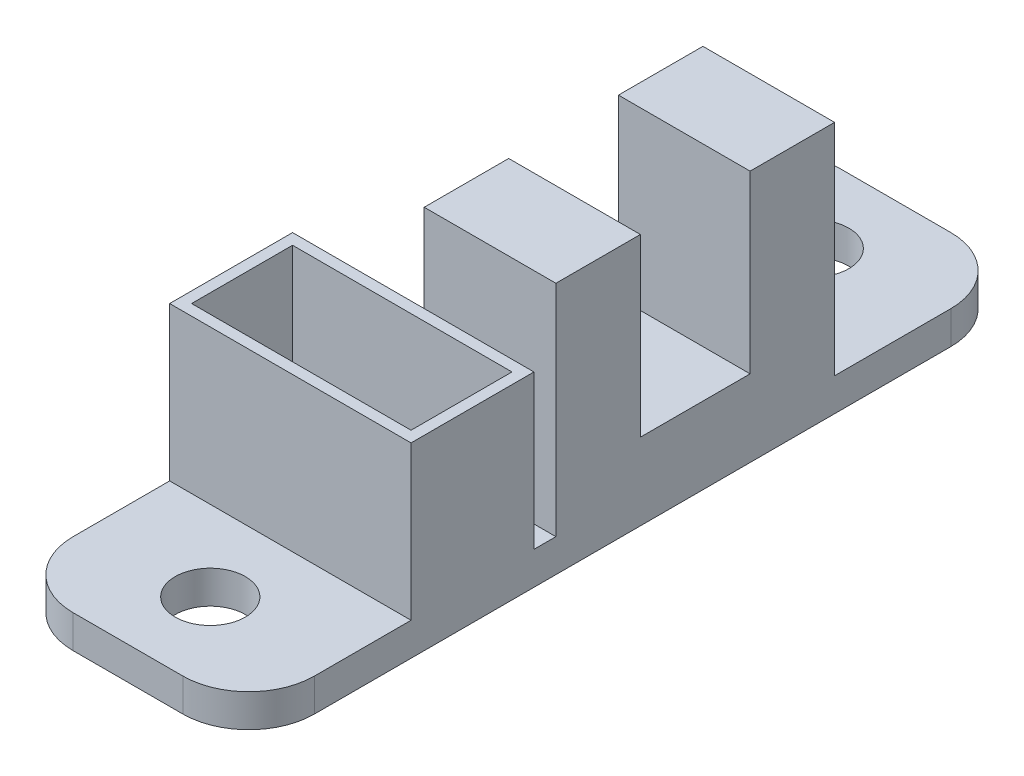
ISO-10303-21;
HEADER;
FILE_DESCRIPTION(('STEP AP214'),'2;1');
FILE_NAME('part.step','',(''),(''),'','','');
FILE_SCHEMA(('AUTOMOTIVE_DESIGN { 1 0 10303 214 1 1 1 1 }'));
ENDSEC;
DATA;
#1=APPLICATION_CONTEXT('core data for automotive mechanical design processes');
#2=APPLICATION_PROTOCOL_DEFINITION('international standard','automotive_design',2000,#1);
#3=PRODUCT_CONTEXT('',#1,'mechanical');
#4=PRODUCT('Part','Part','',(#3));
#5=PRODUCT_RELATED_PRODUCT_CATEGORY('part','',(#4));
#6=PRODUCT_DEFINITION_FORMATION('','',#4);
#7=PRODUCT_DEFINITION_CONTEXT('part definition',#1,'design');
#8=PRODUCT_DEFINITION('design','',#6,#7);
#9=PRODUCT_DEFINITION_SHAPE('','',#8);
#10=(LENGTH_UNIT() NAMED_UNIT(*) SI_UNIT(.MILLI.,.METRE.));
#11=(NAMED_UNIT(*) PLANE_ANGLE_UNIT() SI_UNIT($,.RADIAN.));
#12=(NAMED_UNIT(*) SI_UNIT($,.STERADIAN.) SOLID_ANGLE_UNIT());
#13=UNCERTAINTY_MEASURE_WITH_UNIT(LENGTH_MEASURE(1.E-05),#10,'distance_accuracy_value','');
#14=(GEOMETRIC_REPRESENTATION_CONTEXT(3) GLOBAL_UNCERTAINTY_ASSIGNED_CONTEXT((#13)) GLOBAL_UNIT_ASSIGNED_CONTEXT((#10,
#11,#12)) REPRESENTATION_CONTEXT('',''));
#15=CARTESIAN_POINT('',(0.,0.,0.));
#16=DIRECTION('',(0.,0.,1.));
#17=DIRECTION('',(1.,0.,0.));
#18=AXIS2_PLACEMENT_3D('',#15,#16,#17);
#19=CARTESIAN_POINT('',(0.,1.5,0.));
#20=DIRECTION('',(0.,-1.,0.));
#21=DIRECTION('',(0.,0.,-1.));
#22=AXIS2_PLACEMENT_3D('',#19,#20,#21);
#23=PLANE('',#22);
#24=CARTESIAN_POINT('',(0.,1.5,13.75));
#25=DIRECTION('',(0.,1.,0.));
#26=DIRECTION('',(0.,0.,-1.));
#27=AXIS2_PLACEMENT_3D('',#24,#25,#26);
#28=CIRCLE('',#27,1.6);
#29=CARTESIAN_POINT('',(0.,1.5,12.15));
#30=VERTEX_POINT('',#29);
#31=EDGE_CURVE('E316',#30,#30,#28,.T.);
#32=ORIENTED_EDGE('',*,*,#31,.F.);
#33=EDGE_LOOP('',(#32));
#34=FACE_BOUND('',#33,.T.);
#35=DIRECTION('',(1.,0.,0.));
#36=VECTOR('',#35,1.);
#37=CARTESIAN_POINT('',(-5.5,1.5,10.1));
#38=LINE('',#37,#36);
#39=CARTESIAN_POINT('',(-5.5,1.5,10.1));
#40=VERTEX_POINT('',#39);
#41=CARTESIAN_POINT('',(5.5,1.5,10.1));
#42=VERTEX_POINT('',#41);
#43=EDGE_CURVE('E230',#40,#42,#38,.T.);
#44=ORIENTED_EDGE('',*,*,#43,.F.);
#45=DIRECTION('',(0.,0.,1.));
#46=VECTOR('',#45,1.);
#47=CARTESIAN_POINT('',(-5.5,1.5,17.5));
#48=LINE('',#47,#46);
#49=CARTESIAN_POINT('',(-5.5,1.5,14.5));
#50=VERTEX_POINT('',#49);
#51=EDGE_CURVE('E336',#40,#50,#48,.T.);
#52=ORIENTED_EDGE('',*,*,#51,.T.);
#53=CARTESIAN_POINT('',(-2.5,1.5,14.5));
#54=DIRECTION('',(0.,-1.,0.));
#55=DIRECTION('',(0.,0.,-1.));
#56=AXIS2_PLACEMENT_3D('',#53,#54,#55);
#57=CIRCLE('',#56,3.);
#58=CARTESIAN_POINT('',(-2.5,1.5,17.5));
#59=VERTEX_POINT('',#58);
#60=EDGE_CURVE('E376',#50,#59,#57,.F.);
#61=ORIENTED_EDGE('',*,*,#60,.T.);
#62=DIRECTION('',(1.,0.,0.));
#63=VECTOR('',#62,1.);
#64=CARTESIAN_POINT('',(-5.5,1.5,17.5));
#65=LINE('',#64,#63);
#66=CARTESIAN_POINT('',(2.5,1.5,17.5));
#67=VERTEX_POINT('',#66);
#68=EDGE_CURVE('E339',#59,#67,#65,.T.);
#69=ORIENTED_EDGE('',*,*,#68,.T.);
#70=CARTESIAN_POINT('',(2.5,1.5,14.5));
#71=DIRECTION('',(0.,-1.,0.));
#72=DIRECTION('',(0.,0.,-1.));
#73=AXIS2_PLACEMENT_3D('',#70,#71,#72);
#74=CIRCLE('',#73,3.);
#75=CARTESIAN_POINT('',(5.5,1.5,14.5));
#76=VERTEX_POINT('',#75);
#77=EDGE_CURVE('E378',#67,#76,#74,.F.);
#78=ORIENTED_EDGE('',*,*,#77,.T.);
#79=DIRECTION('',(0.,0.,-1.));
#80=VECTOR('',#79,1.);
#81=CARTESIAN_POINT('',(5.5,1.5,17.5));
#82=LINE('',#81,#80);
#83=EDGE_CURVE('E329',#76,#42,#82,.T.);
#84=ORIENTED_EDGE('',*,*,#83,.T.);
#85=EDGE_LOOP('',(#44,#52,#61,#69,#78,#84));
#86=FACE_BOUND('',#85,.T.);
#87=ADVANCED_FACE('F34',(#34,#86),#23,.F.);
#88=CARTESIAN_POINT('',(0.,1.5,-13.75));
#89=DIRECTION('',(0.,1.,0.));
#90=DIRECTION('',(0.,0.,1.));
#91=AXIS2_PLACEMENT_3D('',#88,#89,#90);
#92=CIRCLE('',#91,1.6);
#93=CARTESIAN_POINT('',(0.,1.5,-12.15));
#94=VERTEX_POINT('',#93);
#95=EDGE_CURVE('E321',#94,#94,#92,.T.);
#96=ORIENTED_EDGE('',*,*,#95,.F.);
#97=EDGE_LOOP('',(#96));
#98=FACE_BOUND('',#97,.T.);
#99=DIRECTION('',(-1.,0.,0.));
#100=VECTOR('',#99,1.);
#101=CARTESIAN_POINT('',(-5.5,1.5,4.5));
#102=LINE('',#101,#100);
#103=CARTESIAN_POINT('',(5.5,1.5,4.5));
#104=VERTEX_POINT('',#103);
#105=CARTESIAN_POINT('',(-5.5,1.5,4.5));
#106=VERTEX_POINT('',#105);
#107=EDGE_CURVE('E57',#104,#106,#102,.T.);
#108=ORIENTED_EDGE('',*,*,#107,.F.);
#109=CARTESIAN_POINT('',(5.5,1.5,3.5));
#110=VERTEX_POINT('',#109);
#111=EDGE_CURVE('E332',#104,#110,#82,.T.);
#112=ORIENTED_EDGE('',*,*,#111,.T.);
#113=DIRECTION('',(1.,0.,0.));
#114=VECTOR('',#113,1.);
#115=CARTESIAN_POINT('',(5.5,1.5,3.5));
#116=LINE('',#115,#114);
#117=CARTESIAN_POINT('',(-0.499999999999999,1.5,3.5));
#118=VERTEX_POINT('',#117);
#119=EDGE_CURVE('E302',#118,#110,#116,.T.);
#120=ORIENTED_EDGE('',*,*,#119,.F.);
#121=DIRECTION('',(0.,0.,1.));
#122=VECTOR('',#121,1.);
#123=CARTESIAN_POINT('',(-0.500000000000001,1.5,-9.2));
#124=LINE('',#123,#122);
#125=CARTESIAN_POINT('',(-0.500000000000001,1.5,-9.2));
#126=VERTEX_POINT('',#125);
#127=EDGE_CURVE('E299',#126,#118,#124,.T.);
#128=ORIENTED_EDGE('',*,*,#127,.F.);
#129=DIRECTION('',(-1.,0.,0.));
#130=VECTOR('',#129,1.);
#131=CARTESIAN_POINT('',(5.5,1.5,-9.2));
#132=LINE('',#131,#130);
#133=CARTESIAN_POINT('',(5.5,1.5,-9.2));
#134=VERTEX_POINT('',#133);
#135=EDGE_CURVE('E277',#134,#126,#132,.T.);
#136=ORIENTED_EDGE('',*,*,#135,.F.);
#137=CARTESIAN_POINT('',(5.5,1.5,-14.5));
#138=VERTEX_POINT('',#137);
#139=EDGE_CURVE('E333',#134,#138,#82,.T.);
#140=ORIENTED_EDGE('',*,*,#139,.T.);
#141=CARTESIAN_POINT('',(2.5,1.5,-14.5));
#142=DIRECTION('',(0.,-1.,0.));
#143=DIRECTION('',(0.,0.,-1.));
#144=AXIS2_PLACEMENT_3D('',#141,#142,#143);
#145=CIRCLE('',#144,3.);
#146=CARTESIAN_POINT('',(2.5,1.5,-17.5));
#147=VERTEX_POINT('',#146);
#148=EDGE_CURVE('E374',#138,#147,#145,.F.);
#149=ORIENTED_EDGE('',*,*,#148,.T.);
#150=DIRECTION('',(-1.,0.,0.));
#151=VECTOR('',#150,1.);
#152=CARTESIAN_POINT('',(-5.5,1.5,-17.5));
#153=LINE('',#152,#151);
#154=CARTESIAN_POINT('',(-2.5,1.5,-17.5));
#155=VERTEX_POINT('',#154);
#156=EDGE_CURVE('E331',#147,#155,#153,.T.);
#157=ORIENTED_EDGE('',*,*,#156,.T.);
#158=CARTESIAN_POINT('',(-2.5,1.5,-14.5));
#159=DIRECTION('',(0.,-1.,0.));
#160=DIRECTION('',(0.,0.,-1.));
#161=AXIS2_PLACEMENT_3D('',#158,#159,#160);
#162=CIRCLE('',#161,3.);
#163=CARTESIAN_POINT('',(-5.5,1.5,-14.5));
#164=VERTEX_POINT('',#163);
#165=EDGE_CURVE('E372',#155,#164,#162,.F.);
#166=ORIENTED_EDGE('',*,*,#165,.T.);
#167=EDGE_CURVE('E337',#164,#106,#48,.T.);
#168=ORIENTED_EDGE('',*,*,#167,.T.);
#169=EDGE_LOOP('',(#108,#112,#120,#128,#136,#140,#149,#157,#166,#168));
#170=FACE_BOUND('',#169,.T.);
#171=ADVANCED_FACE('F393',(#98,#170),#23,.F.);
#172=CARTESIAN_POINT('',(0.,11.5,0.));
#173=DIRECTION('',(0.,-1.,0.));
#174=DIRECTION('',(0.,0.,-1.));
#175=AXIS2_PLACEMENT_3D('',#172,#173,#174);
#176=PLANE('',#175);
#177=DIRECTION('',(0.,0.,-1.));
#178=VECTOR('',#177,1.);
#179=CARTESIAN_POINT('',(5.5,11.5,-9.2));
#180=LINE('',#179,#178);
#181=CARTESIAN_POINT('',(5.5,11.5,3.5));
#182=VERTEX_POINT('',#181);
#183=CARTESIAN_POINT('',(5.5,11.5,-0.349999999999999));
#184=VERTEX_POINT('',#183);
#185=EDGE_CURVE('E284',#182,#184,#180,.T.);
#186=ORIENTED_EDGE('',*,*,#185,.T.);
#187=DIRECTION('',(1.,0.,0.));
#188=VECTOR('',#187,1.);
#189=CARTESIAN_POINT('',(-0.499999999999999,11.5,-0.349999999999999));
#190=LINE('',#189,#188);
#191=CARTESIAN_POINT('',(-0.499999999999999,11.5,-0.349999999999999));
#192=VERTEX_POINT('',#191);
#193=EDGE_CURVE('E263',#192,#184,#190,.T.);
#194=ORIENTED_EDGE('',*,*,#193,.F.);
#195=DIRECTION('',(0.,0.,1.));
#196=VECTOR('',#195,1.);
#197=CARTESIAN_POINT('',(-0.500000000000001,11.5,-9.2));
#198=LINE('',#197,#196);
#199=CARTESIAN_POINT('',(-0.499999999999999,11.5,3.5));
#200=VERTEX_POINT('',#199);
#201=EDGE_CURVE('E290',#192,#200,#198,.T.);
#202=ORIENTED_EDGE('',*,*,#201,.T.);
#203=DIRECTION('',(1.,0.,0.));
#204=VECTOR('',#203,1.);
#205=CARTESIAN_POINT('',(5.5,11.5,3.5));
#206=LINE('',#205,#204);
#207=EDGE_CURVE('E294',#200,#182,#206,.T.);
#208=ORIENTED_EDGE('',*,*,#207,.T.);
#209=EDGE_LOOP('',(#186,#194,#202,#208));
#210=FACE_BOUND('',#209,.T.);
#211=ADVANCED_FACE('F454',(#210),#176,.F.);
#212=CARTESIAN_POINT('',(5.5,1.5,17.5));
#213=DIRECTION('',(-1.,0.,0.));
#214=DIRECTION('',(0.,0.,1.));
#215=AXIS2_PLACEMENT_3D('',#212,#213,#214);
#216=PLANE('',#215);
#217=DIRECTION('',(0.,0.,-1.));
#218=VECTOR('',#217,1.);
#219=CARTESIAN_POINT('',(5.5,3.5,-0.349999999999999));
#220=LINE('',#219,#218);
#221=CARTESIAN_POINT('',(5.5,3.5,-0.349999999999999));
#222=VERTEX_POINT('',#221);
#223=CARTESIAN_POINT('',(5.5,3.5,-5.35));
#224=VERTEX_POINT('',#223);
#225=EDGE_CURVE('E259',#222,#224,#220,.T.);
#226=ORIENTED_EDGE('',*,*,#225,.F.);
#227=DIRECTION('',(0.,1.,0.));
#228=VECTOR('',#227,1.);
#229=CARTESIAN_POINT('',(5.5,3.5,-0.349999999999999));
#230=LINE('',#229,#228);
#231=EDGE_CURVE('E274',#222,#184,#230,.T.);
#232=ORIENTED_EDGE('',*,*,#231,.T.);
#233=ORIENTED_EDGE('',*,*,#185,.F.);
#234=DIRECTION('',(0.,-1.,0.));
#235=VECTOR('',#234,1.);
#236=CARTESIAN_POINT('',(5.5,11.5,3.5));
#237=LINE('',#236,#235);
#238=EDGE_CURVE('E296',#182,#110,#237,.T.);
#239=ORIENTED_EDGE('',*,*,#238,.T.);
#240=ORIENTED_EDGE('',*,*,#111,.F.);
#241=DIRECTION('',(0.,-1.,0.));
#242=VECTOR('',#241,1.);
#243=CARTESIAN_POINT('',(5.5,8.5,4.5));
#244=LINE('',#243,#242);
#245=CARTESIAN_POINT('',(5.5,8.5,4.5));
#246=VERTEX_POINT('',#245);
#247=EDGE_CURVE('E249',#246,#104,#244,.T.);
#248=ORIENTED_EDGE('',*,*,#247,.F.);
#249=DIRECTION('',(0.,0.,-1.));
#250=VECTOR('',#249,1.);
#251=CARTESIAN_POINT('',(5.5,8.5,4.5));
#252=LINE('',#251,#250);
#253=CARTESIAN_POINT('',(5.5,8.5,10.1));
#254=VERTEX_POINT('',#253);
#255=EDGE_CURVE('E239',#254,#246,#252,.T.);
#256=ORIENTED_EDGE('',*,*,#255,.F.);
#257=DIRECTION('',(0.,-1.,0.));
#258=VECTOR('',#257,1.);
#259=CARTESIAN_POINT('',(5.5,8.5,10.1));
#260=LINE('',#259,#258);
#261=EDGE_CURVE('E252',#254,#42,#260,.T.);
#262=ORIENTED_EDGE('',*,*,#261,.T.);
#263=ORIENTED_EDGE('',*,*,#83,.F.);
#264=DIRECTION('',(0.,-1.,0.));
#265=VECTOR('',#264,1.);
#266=CARTESIAN_POINT('',(5.5,1.5,14.5));
#267=LINE('',#266,#265);
#268=CARTESIAN_POINT('',(5.5,0.,14.5));
#269=VERTEX_POINT('',#268);
#270=EDGE_CURVE('E356',#76,#269,#267,.T.);
#271=ORIENTED_EDGE('',*,*,#270,.T.);
#272=DIRECTION('',(0.,0.,-1.));
#273=VECTOR('',#272,1.);
#274=CARTESIAN_POINT('',(5.5,0.,17.5));
#275=LINE('',#274,#273);
#276=CARTESIAN_POINT('',(5.5,0.,-14.5));
#277=VERTEX_POINT('',#276);
#278=EDGE_CURVE('E320',#269,#277,#275,.T.);
#279=ORIENTED_EDGE('',*,*,#278,.T.);
#280=DIRECTION('',(0.,-1.,0.));
#281=VECTOR('',#280,1.);
#282=CARTESIAN_POINT('',(5.5,1.5,-14.5));
#283=LINE('',#282,#281);
#284=EDGE_CURVE('E342',#277,#138,#283,.F.);
#285=ORIENTED_EDGE('',*,*,#284,.T.);
#286=ORIENTED_EDGE('',*,*,#139,.F.);
#287=DIRECTION('',(0.,-1.,0.));
#288=VECTOR('',#287,1.);
#289=CARTESIAN_POINT('',(5.5,11.5,-9.2));
#290=LINE('',#289,#288);
#291=CARTESIAN_POINT('',(5.5,11.5,-9.2));
#292=VERTEX_POINT('',#291);
#293=EDGE_CURVE('E313',#292,#134,#290,.T.);
#294=ORIENTED_EDGE('',*,*,#293,.F.);
#295=CARTESIAN_POINT('',(5.5,11.5,-5.35));
#296=VERTEX_POINT('',#295);
#297=EDGE_CURVE('E288',#296,#292,#180,.T.);
#298=ORIENTED_EDGE('',*,*,#297,.F.);
#299=DIRECTION('',(0.,1.,0.));
#300=VECTOR('',#299,1.);
#301=CARTESIAN_POINT('',(5.5,3.5,-5.35));
#302=LINE('',#301,#300);
#303=EDGE_CURVE('E271',#224,#296,#302,.T.);
#304=ORIENTED_EDGE('',*,*,#303,.F.);
#305=EDGE_LOOP('',(#226,#232,#233,#239,#240,#248,#256,#262,#263,#271,#279,#285,#286,#294,#298,#304));
#306=FACE_BOUND('',#305,.T.);
#307=ADVANCED_FACE('F422',(#306),#216,.F.);
#308=CARTESIAN_POINT('',(-5.5,1.5,-17.5));
#309=DIRECTION('',(0.,0.,1.));
#310=DIRECTION('',(1.,0.,0.));
#311=AXIS2_PLACEMENT_3D('',#308,#309,#310);
#312=PLANE('',#311);
#313=ORIENTED_EDGE('',*,*,#156,.F.);
#314=DIRECTION('',(0.,-1.,0.));
#315=VECTOR('',#314,1.);
#316=CARTESIAN_POINT('',(2.5,1.5,-17.5));
#317=LINE('',#316,#315);
#318=CARTESIAN_POINT('',(2.5,0.,-17.5));
#319=VERTEX_POINT('',#318);
#320=EDGE_CURVE('E11',#147,#319,#317,.T.);
#321=ORIENTED_EDGE('',*,*,#320,.T.);
#322=DIRECTION('',(-1.,0.,0.));
#323=VECTOR('',#322,1.);
#324=CARTESIAN_POINT('',(-5.5,0.,-17.5));
#325=LINE('',#324,#323);
#326=CARTESIAN_POINT('',(-2.5,0.,-17.5));
#327=VERTEX_POINT('',#326);
#328=EDGE_CURVE('E345',#319,#327,#325,.T.);
#329=ORIENTED_EDGE('',*,*,#328,.T.);
#330=DIRECTION('',(0.,-1.,0.));
#331=VECTOR('',#330,1.);
#332=CARTESIAN_POINT('',(-2.5,1.5,-17.5));
#333=LINE('',#332,#331);
#334=EDGE_CURVE('E42',#327,#155,#333,.F.);
#335=ORIENTED_EDGE('',*,*,#334,.T.);
#336=EDGE_LOOP('',(#313,#321,#329,#335));
#337=FACE_BOUND('',#336,.T.);
#338=ADVANCED_FACE('F388',(#337),#312,.F.);
#339=CARTESIAN_POINT('',(-5.5,1.5,17.5));
#340=DIRECTION('',(1.,0.,0.));
#341=DIRECTION('',(0.,0.,-1.));
#342=AXIS2_PLACEMENT_3D('',#339,#340,#341);
#343=PLANE('',#342);
#344=DIRECTION('',(0.,0.,1.));
#345=VECTOR('',#344,1.);
#346=CARTESIAN_POINT('',(-5.5,0.,17.5));
#347=LINE('',#346,#345);
#348=CARTESIAN_POINT('',(-5.5,0.,-14.5));
#349=VERTEX_POINT('',#348);
#350=CARTESIAN_POINT('',(-5.5,0.,14.5));
#351=VERTEX_POINT('',#350);
#352=EDGE_CURVE('E348',#349,#351,#347,.T.);
#353=ORIENTED_EDGE('',*,*,#352,.T.);
#354=DIRECTION('',(0.,-1.,0.));
#355=VECTOR('',#354,1.);
#356=CARTESIAN_POINT('',(-5.5,1.5,14.5));
#357=LINE('',#356,#355);
#358=EDGE_CURVE('E383',#351,#50,#357,.F.);
#359=ORIENTED_EDGE('',*,*,#358,.T.);
#360=ORIENTED_EDGE('',*,*,#51,.F.);
#361=DIRECTION('',(0.,-1.,0.));
#362=VECTOR('',#361,1.);
#363=CARTESIAN_POINT('',(-5.5,8.5,10.1));
#364=LINE('',#363,#362);
#365=CARTESIAN_POINT('',(-5.5,8.5,10.1));
#366=VERTEX_POINT('',#365);
#367=EDGE_CURVE('E255',#366,#40,#364,.T.);
#368=ORIENTED_EDGE('',*,*,#367,.F.);
#369=DIRECTION('',(0.,0.,1.));
#370=VECTOR('',#369,1.);
#371=CARTESIAN_POINT('',(-5.5,8.5,4.5));
#372=LINE('',#371,#370);
#373=CARTESIAN_POINT('',(-5.5,8.5,4.5));
#374=VERTEX_POINT('',#373);
#375=EDGE_CURVE('E234',#374,#366,#372,.T.);
#376=ORIENTED_EDGE('',*,*,#375,.F.);
#377=DIRECTION('',(0.,-1.,0.));
#378=VECTOR('',#377,1.);
#379=CARTESIAN_POINT('',(-5.5,8.5,4.5));
#380=LINE('',#379,#378);
#381=EDGE_CURVE('E243',#374,#106,#380,.T.);
#382=ORIENTED_EDGE('',*,*,#381,.T.);
#383=ORIENTED_EDGE('',*,*,#167,.F.);
#384=DIRECTION('',(0.,-1.,0.));
#385=VECTOR('',#384,1.);
#386=CARTESIAN_POINT('',(-5.5,1.5,-14.5));
#387=LINE('',#386,#385);
#388=EDGE_CURVE('E380',#164,#349,#387,.T.);
#389=ORIENTED_EDGE('',*,*,#388,.T.);
#390=EDGE_LOOP('',(#353,#359,#360,#368,#376,#382,#383,#389));
#391=FACE_BOUND('',#390,.T.);
#392=ADVANCED_FACE('F399',(#391),#343,.F.);
#393=CARTESIAN_POINT('',(-5.5,1.5,17.5));
#394=DIRECTION('',(0.,0.,-1.));
#395=DIRECTION('',(-1.,0.,0.));
#396=AXIS2_PLACEMENT_3D('',#393,#394,#395);
#397=PLANE('',#396);
#398=DIRECTION('',(1.,0.,0.));
#399=VECTOR('',#398,1.);
#400=CARTESIAN_POINT('',(-5.5,0.,17.5));
#401=LINE('',#400,#399);
#402=CARTESIAN_POINT('',(-2.5,0.,17.5));
#403=VERTEX_POINT('',#402);
#404=CARTESIAN_POINT('',(2.5,0.,17.5));
#405=VERTEX_POINT('',#404);
#406=EDGE_CURVE('E351',#403,#405,#401,.T.);
#407=ORIENTED_EDGE('',*,*,#406,.T.);
#408=DIRECTION('',(0.,-1.,0.));
#409=VECTOR('',#408,1.);
#410=CARTESIAN_POINT('',(2.5,1.5,17.5));
#411=LINE('',#410,#409);
#412=EDGE_CURVE('E370',#405,#67,#411,.F.);
#413=ORIENTED_EDGE('',*,*,#412,.T.);
#414=ORIENTED_EDGE('',*,*,#68,.F.);
#415=DIRECTION('',(0.,-1.,0.));
#416=VECTOR('',#415,1.);
#417=CARTESIAN_POINT('',(-2.5,1.5,17.5));
#418=LINE('',#417,#416);
#419=EDGE_CURVE('E367',#59,#403,#418,.T.);
#420=ORIENTED_EDGE('',*,*,#419,.T.);
#421=EDGE_LOOP('',(#407,#413,#414,#420));
#422=FACE_BOUND('',#421,.T.);
#423=ADVANCED_FACE('F411',(#422),#397,.F.);
#424=CARTESIAN_POINT('',(0.,0.,0.));
#425=DIRECTION('',(0.,-1.,0.));
#426=DIRECTION('',(0.,0.,-1.));
#427=AXIS2_PLACEMENT_3D('',#424,#425,#426);
#428=PLANE('',#427);
#429=CARTESIAN_POINT('',(0.,0.,-13.75));
#430=DIRECTION('',(0.,1.,0.));
#431=DIRECTION('',(0.,0.,1.));
#432=AXIS2_PLACEMENT_3D('',#429,#430,#431);
#433=CIRCLE('',#432,1.6);
#434=CARTESIAN_POINT('',(0.,0.,-12.15));
#435=VERTEX_POINT('',#434);
#436=EDGE_CURVE('E317',#435,#435,#433,.T.);
#437=ORIENTED_EDGE('',*,*,#436,.T.);
#438=EDGE_LOOP('',(#437));
#439=FACE_BOUND('',#438,.T.);
#440=CARTESIAN_POINT('',(0.,0.,13.75));
#441=DIRECTION('',(0.,1.,0.));
#442=DIRECTION('',(0.,0.,-1.));
#443=AXIS2_PLACEMENT_3D('',#440,#441,#442);
#444=CIRCLE('',#443,1.6);
#445=CARTESIAN_POINT('',(0.,0.,12.15));
#446=VERTEX_POINT('',#445);
#447=EDGE_CURVE('E324',#446,#446,#444,.T.);
#448=ORIENTED_EDGE('',*,*,#447,.T.);
#449=EDGE_LOOP('',(#448));
#450=FACE_BOUND('',#449,.T.);
#451=ORIENTED_EDGE('',*,*,#278,.F.);
#452=CARTESIAN_POINT('',(2.5,0.,14.5));
#453=DIRECTION('',(0.,-1.,0.));
#454=DIRECTION('',(0.,0.,-1.));
#455=AXIS2_PLACEMENT_3D('',#452,#453,#454);
#456=CIRCLE('',#455,3.);
#457=EDGE_CURVE('E365',#269,#405,#456,.T.);
#458=ORIENTED_EDGE('',*,*,#457,.T.);
#459=ORIENTED_EDGE('',*,*,#406,.F.);
#460=CARTESIAN_POINT('',(-2.5,0.,14.5));
#461=DIRECTION('',(0.,-1.,0.));
#462=DIRECTION('',(0.,0.,-1.));
#463=AXIS2_PLACEMENT_3D('',#460,#461,#462);
#464=CIRCLE('',#463,3.);
#465=EDGE_CURVE('E363',#403,#351,#464,.T.);
#466=ORIENTED_EDGE('',*,*,#465,.T.);
#467=ORIENTED_EDGE('',*,*,#352,.F.);
#468=CARTESIAN_POINT('',(-2.5,0.,-14.5));
#469=DIRECTION('',(0.,-1.,0.));
#470=DIRECTION('',(0.,0.,-1.));
#471=AXIS2_PLACEMENT_3D('',#468,#469,#470);
#472=CIRCLE('',#471,3.);
#473=EDGE_CURVE('E359',#349,#327,#472,.T.);
#474=ORIENTED_EDGE('',*,*,#473,.T.);
#475=ORIENTED_EDGE('',*,*,#328,.F.);
#476=CARTESIAN_POINT('',(2.5,0.,-14.5));
#477=DIRECTION('',(0.,-1.,0.));
#478=DIRECTION('',(0.,0.,-1.));
#479=AXIS2_PLACEMENT_3D('',#476,#477,#478);
#480=CIRCLE('',#479,3.);
#481=EDGE_CURVE('E361',#319,#277,#480,.T.);
#482=ORIENTED_EDGE('',*,*,#481,.T.);
#483=EDGE_LOOP('',(#451,#458,#459,#466,#467,#474,#475,#482));
#484=FACE_BOUND('',#483,.T.);
#485=ADVANCED_FACE('F403',(#439,#450,#484),#428,.T.);
#486=CARTESIAN_POINT('',(0.,0.,13.75));
#487=DIRECTION('',(0.,1.,0.));
#488=DIRECTION('',(0.,0.,1.));
#489=AXIS2_PLACEMENT_3D('',#486,#487,#488);
#490=CYLINDRICAL_SURFACE('',#489,1.6);
#491=ORIENTED_EDGE('',*,*,#447,.F.);
#492=EDGE_LOOP('',(#491));
#493=FACE_BOUND('',#492,.T.);
#494=ORIENTED_EDGE('',*,*,#31,.T.);
#495=EDGE_LOOP('',(#494));
#496=FACE_BOUND('',#495,.T.);
#497=ADVANCED_FACE('F478',(#493,#496),#490,.F.);
#498=CARTESIAN_POINT('',(0.,0.,-13.75));
#499=DIRECTION('',(0.,1.,0.));
#500=DIRECTION('',(0.,0.,1.));
#501=AXIS2_PLACEMENT_3D('',#498,#499,#500);
#502=CYLINDRICAL_SURFACE('',#501,1.6);
#503=ORIENTED_EDGE('',*,*,#436,.F.);
#504=EDGE_LOOP('',(#503));
#505=FACE_BOUND('',#504,.T.);
#506=ORIENTED_EDGE('',*,*,#95,.T.);
#507=EDGE_LOOP('',(#506));
#508=FACE_BOUND('',#507,.T.);
#509=ADVANCED_FACE('F493',(#505,#508),#502,.F.);
#510=CARTESIAN_POINT('',(2.5,1.5,14.5));
#511=DIRECTION('',(0.,-1.,0.));
#512=DIRECTION('',(0.,0.,-1.));
#513=AXIS2_PLACEMENT_3D('',#510,#511,#512);
#514=CYLINDRICAL_SURFACE('',#513,3.);
#515=ORIENTED_EDGE('',*,*,#77,.F.);
#516=ORIENTED_EDGE('',*,*,#412,.F.);
#517=ORIENTED_EDGE('',*,*,#457,.F.);
#518=ORIENTED_EDGE('',*,*,#270,.F.);
#519=EDGE_LOOP('',(#515,#516,#517,#518));
#520=FACE_BOUND('',#519,.T.);
#521=ADVANCED_FACE('F419',(#520),#514,.T.);
#522=CARTESIAN_POINT('',(-2.5,1.5,14.5));
#523=DIRECTION('',(0.,-1.,0.));
#524=DIRECTION('',(0.,0.,-1.));
#525=AXIS2_PLACEMENT_3D('',#522,#523,#524);
#526=CYLINDRICAL_SURFACE('',#525,3.);
#527=ORIENTED_EDGE('',*,*,#60,.F.);
#528=ORIENTED_EDGE('',*,*,#358,.F.);
#529=ORIENTED_EDGE('',*,*,#465,.F.);
#530=ORIENTED_EDGE('',*,*,#419,.F.);
#531=EDGE_LOOP('',(#527,#528,#529,#530));
#532=FACE_BOUND('',#531,.T.);
#533=ADVANCED_FACE('F408',(#532),#526,.T.);
#534=CARTESIAN_POINT('',(2.5,1.5,-14.5));
#535=DIRECTION('',(0.,-1.,0.));
#536=DIRECTION('',(0.,0.,-1.));
#537=AXIS2_PLACEMENT_3D('',#534,#535,#536);
#538=CYLINDRICAL_SURFACE('',#537,3.);
#539=ORIENTED_EDGE('',*,*,#148,.F.);
#540=ORIENTED_EDGE('',*,*,#284,.F.);
#541=ORIENTED_EDGE('',*,*,#481,.F.);
#542=ORIENTED_EDGE('',*,*,#320,.F.);
#543=EDGE_LOOP('',(#539,#540,#541,#542));
#544=FACE_BOUND('',#543,.T.);
#545=ADVANCED_FACE('F425',(#544),#538,.T.);
#546=CARTESIAN_POINT('',(-2.5,1.5,-14.5));
#547=DIRECTION('',(0.,-1.,0.));
#548=DIRECTION('',(0.,0.,-1.));
#549=AXIS2_PLACEMENT_3D('',#546,#547,#548);
#550=CYLINDRICAL_SURFACE('',#549,3.);
#551=ORIENTED_EDGE('',*,*,#165,.F.);
#552=ORIENTED_EDGE('',*,*,#334,.F.);
#553=ORIENTED_EDGE('',*,*,#473,.F.);
#554=ORIENTED_EDGE('',*,*,#388,.F.);
#555=EDGE_LOOP('',(#551,#552,#553,#554));
#556=FACE_BOUND('',#555,.T.);
#557=ADVANCED_FACE('F36',(#556),#550,.T.);
#558=CARTESIAN_POINT('',(5.5,11.5,-9.2));
#559=DIRECTION('',(0.,0.,1.));
#560=DIRECTION('',(1.,0.,0.));
#561=AXIS2_PLACEMENT_3D('',#558,#559,#560);
#562=PLANE('',#561);
#563=ORIENTED_EDGE('',*,*,#135,.T.);
#564=DIRECTION('',(0.,-1.,0.));
#565=VECTOR('',#564,1.);
#566=CARTESIAN_POINT('',(-0.500000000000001,11.5,-9.2));
#567=LINE('',#566,#565);
#568=CARTESIAN_POINT('',(-0.500000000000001,11.5,-9.2));
#569=VERTEX_POINT('',#568);
#570=EDGE_CURVE('E310',#569,#126,#567,.T.);
#571=ORIENTED_EDGE('',*,*,#570,.F.);
#572=DIRECTION('',(-1.,0.,0.));
#573=VECTOR('',#572,1.);
#574=CARTESIAN_POINT('',(5.5,11.5,-9.2));
#575=LINE('',#574,#573);
#576=EDGE_CURVE('E287',#292,#569,#575,.T.);
#577=ORIENTED_EDGE('',*,*,#576,.F.);
#578=ORIENTED_EDGE('',*,*,#293,.T.);
#579=EDGE_LOOP('',(#563,#571,#577,#578));
#580=FACE_BOUND('',#579,.T.);
#581=ADVANCED_FACE('F431',(#580),#562,.F.);
#582=CARTESIAN_POINT('',(-0.500000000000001,11.5,-9.2));
#583=DIRECTION('',(1.,0.,0.));
#584=DIRECTION('',(0.,0.,-1.));
#585=AXIS2_PLACEMENT_3D('',#582,#583,#584);
#586=PLANE('',#585);
#587=ORIENTED_EDGE('',*,*,#201,.F.);
#588=DIRECTION('',(0.,1.,0.));
#589=VECTOR('',#588,1.);
#590=CARTESIAN_POINT('',(-0.499999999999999,3.5,-0.349999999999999));
#591=LINE('',#590,#589);
#592=CARTESIAN_POINT('',(-0.499999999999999,3.5,-0.349999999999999));
#593=VERTEX_POINT('',#592);
#594=EDGE_CURVE('E278',#593,#192,#591,.T.);
#595=ORIENTED_EDGE('',*,*,#594,.F.);
#596=DIRECTION('',(0.,0.,1.));
#597=VECTOR('',#596,1.);
#598=CARTESIAN_POINT('',(-0.499999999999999,3.5,-0.349999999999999));
#599=LINE('',#598,#597);
#600=CARTESIAN_POINT('',(-0.499999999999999,3.5,-5.35));
#601=VERTEX_POINT('',#600);
#602=EDGE_CURVE('E266',#601,#593,#599,.T.);
#603=ORIENTED_EDGE('',*,*,#602,.F.);
#604=DIRECTION('',(0.,1.,0.));
#605=VECTOR('',#604,1.);
#606=CARTESIAN_POINT('',(-0.499999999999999,3.5,-5.35));
#607=LINE('',#606,#605);
#608=CARTESIAN_POINT('',(-0.499999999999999,11.5,-5.35));
#609=VERTEX_POINT('',#608);
#610=EDGE_CURVE('E280',#601,#609,#607,.T.);
#611=ORIENTED_EDGE('',*,*,#610,.T.);
#612=EDGE_CURVE('E291',#569,#609,#198,.T.);
#613=ORIENTED_EDGE('',*,*,#612,.F.);
#614=ORIENTED_EDGE('',*,*,#570,.T.);
#615=ORIENTED_EDGE('',*,*,#127,.T.);
#616=DIRECTION('',(0.,-1.,0.));
#617=VECTOR('',#616,1.);
#618=CARTESIAN_POINT('',(-0.499999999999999,11.5,3.5));
#619=LINE('',#618,#617);
#620=EDGE_CURVE('E307',#200,#118,#619,.T.);
#621=ORIENTED_EDGE('',*,*,#620,.F.);
#622=EDGE_LOOP('',(#587,#595,#603,#611,#613,#614,#615,#621));
#623=FACE_BOUND('',#622,.T.);
#624=ADVANCED_FACE('F450',(#623),#586,.F.);
#625=CARTESIAN_POINT('',(5.5,11.5,3.5));
#626=DIRECTION('',(0.,0.,-1.));
#627=DIRECTION('',(-1.,0.,0.));
#628=AXIS2_PLACEMENT_3D('',#625,#626,#627);
#629=PLANE('',#628);
#630=ORIENTED_EDGE('',*,*,#119,.T.);
#631=ORIENTED_EDGE('',*,*,#238,.F.);
#632=ORIENTED_EDGE('',*,*,#207,.F.);
#633=ORIENTED_EDGE('',*,*,#620,.T.);
#634=EDGE_LOOP('',(#630,#631,#632,#633));
#635=FACE_BOUND('',#634,.T.);
#636=ADVANCED_FACE('F459',(#635),#629,.F.);
#637=ORIENTED_EDGE('',*,*,#612,.T.);
#638=DIRECTION('',(-1.,0.,0.));
#639=VECTOR('',#638,1.);
#640=CARTESIAN_POINT('',(-0.499999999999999,11.5,-5.35));
#641=LINE('',#640,#639);
#642=EDGE_CURVE('E258',#296,#609,#641,.T.);
#643=ORIENTED_EDGE('',*,*,#642,.F.);
#644=ORIENTED_EDGE('',*,*,#297,.T.);
#645=ORIENTED_EDGE('',*,*,#576,.T.);
#646=EDGE_LOOP('',(#637,#643,#644,#645));
#647=FACE_BOUND('',#646,.T.);
#648=ADVANCED_FACE('F435',(#647),#176,.F.);
#649=CARTESIAN_POINT('',(-0.499999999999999,3.5,-0.349999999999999));
#650=DIRECTION('',(0.,0.,1.));
#651=DIRECTION('',(1.,0.,0.));
#652=AXIS2_PLACEMENT_3D('',#649,#650,#651);
#653=PLANE('',#652);
#654=ORIENTED_EDGE('',*,*,#193,.T.);
#655=ORIENTED_EDGE('',*,*,#231,.F.);
#656=DIRECTION('',(1.,0.,0.));
#657=VECTOR('',#656,1.);
#658=CARTESIAN_POINT('',(-0.499999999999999,3.5,-0.349999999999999));
#659=LINE('',#658,#657);
#660=EDGE_CURVE('E268',#593,#222,#659,.T.);
#661=ORIENTED_EDGE('',*,*,#660,.F.);
#662=ORIENTED_EDGE('',*,*,#594,.T.);
#663=EDGE_LOOP('',(#654,#655,#661,#662));
#664=FACE_BOUND('',#663,.T.);
#665=ADVANCED_FACE('F446',(#664),#653,.F.);
#666=CARTESIAN_POINT('',(-0.499999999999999,3.5,-5.35));
#667=DIRECTION('',(0.,0.,-1.));
#668=DIRECTION('',(-1.,0.,0.));
#669=AXIS2_PLACEMENT_3D('',#666,#667,#668);
#670=PLANE('',#669);
#671=ORIENTED_EDGE('',*,*,#642,.T.);
#672=ORIENTED_EDGE('',*,*,#610,.F.);
#673=DIRECTION('',(-1.,0.,0.));
#674=VECTOR('',#673,1.);
#675=CARTESIAN_POINT('',(-0.499999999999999,3.5,-5.35));
#676=LINE('',#675,#674);
#677=EDGE_CURVE('E262',#224,#601,#676,.T.);
#678=ORIENTED_EDGE('',*,*,#677,.F.);
#679=ORIENTED_EDGE('',*,*,#303,.T.);
#680=EDGE_LOOP('',(#671,#672,#678,#679));
#681=FACE_BOUND('',#680,.T.);
#682=ADVANCED_FACE('F439',(#681),#670,.F.);
#683=CARTESIAN_POINT('',(0.,3.5,0.));
#684=DIRECTION('',(0.,-1.,0.));
#685=DIRECTION('',(0.,0.,-1.));
#686=AXIS2_PLACEMENT_3D('',#683,#684,#685);
#687=PLANE('',#686);
#688=ORIENTED_EDGE('',*,*,#225,.T.);
#689=ORIENTED_EDGE('',*,*,#677,.T.);
#690=ORIENTED_EDGE('',*,*,#602,.T.);
#691=ORIENTED_EDGE('',*,*,#660,.T.);
#692=EDGE_LOOP('',(#688,#689,#690,#691));
#693=FACE_BOUND('',#692,.T.);
#694=ADVANCED_FACE('F442',(#693),#687,.F.);
#695=CARTESIAN_POINT('',(-5.5,8.5,10.1));
#696=DIRECTION('',(0.,0.,-1.));
#697=DIRECTION('',(-1.,0.,0.));
#698=AXIS2_PLACEMENT_3D('',#695,#696,#697);
#699=PLANE('',#698);
#700=ORIENTED_EDGE('',*,*,#43,.T.);
#701=ORIENTED_EDGE('',*,*,#261,.F.);
#702=DIRECTION('',(1.,0.,0.));
#703=VECTOR('',#702,1.);
#704=CARTESIAN_POINT('',(-5.5,8.5,10.1));
#705=LINE('',#704,#703);
#706=EDGE_CURVE('E237',#366,#254,#705,.T.);
#707=ORIENTED_EDGE('',*,*,#706,.F.);
#708=ORIENTED_EDGE('',*,*,#367,.T.);
#709=EDGE_LOOP('',(#700,#701,#707,#708));
#710=FACE_BOUND('',#709,.T.);
#711=ADVANCED_FACE('F564',(#710),#699,.F.);
#712=CARTESIAN_POINT('',(-5.5,8.5,4.5));
#713=DIRECTION('',(0.,0.,1.));
#714=DIRECTION('',(1.,0.,0.));
#715=AXIS2_PLACEMENT_3D('',#712,#713,#714);
#716=PLANE('',#715);
#717=ORIENTED_EDGE('',*,*,#107,.T.);
#718=ORIENTED_EDGE('',*,*,#381,.F.);
#719=DIRECTION('',(-1.,0.,0.));
#720=VECTOR('',#719,1.);
#721=CARTESIAN_POINT('',(-5.5,8.5,4.5));
#722=LINE('',#721,#720);
#723=EDGE_CURVE('E241',#246,#374,#722,.T.);
#724=ORIENTED_EDGE('',*,*,#723,.F.);
#725=ORIENTED_EDGE('',*,*,#247,.T.);
#726=EDGE_LOOP('',(#717,#718,#724,#725));
#727=FACE_BOUND('',#726,.T.);
#728=ADVANCED_FACE('F652',(#727),#716,.F.);
#729=CARTESIAN_POINT('',(0.,8.5,0.));
#730=DIRECTION('',(0.,1.,0.));
#731=DIRECTION('',(0.,0.,1.));
#732=AXIS2_PLACEMENT_3D('',#729,#730,#731);
#733=PLANE('',#732);
#734=DIRECTION('',(0.,0.,1.));
#735=VECTOR('',#734,1.);
#736=CARTESIAN_POINT('',(-5.,8.5,5.));
#737=LINE('',#736,#735);
#738=CARTESIAN_POINT('',(-5.,8.5,5.));
#739=VERTEX_POINT('',#738);
#740=CARTESIAN_POINT('',(-5.,8.5,9.6));
#741=VERTEX_POINT('',#740);
#742=EDGE_CURVE('E49',#739,#741,#737,.T.);
#743=ORIENTED_EDGE('',*,*,#742,.F.);
#744=DIRECTION('',(-1.,0.,0.));
#745=VECTOR('',#744,1.);
#746=CARTESIAN_POINT('',(-5.,8.5,5.));
#747=LINE('',#746,#745);
#748=CARTESIAN_POINT('',(5.,8.5,5.));
#749=VERTEX_POINT('',#748);
#750=EDGE_CURVE('E215',#749,#739,#747,.T.);
#751=ORIENTED_EDGE('',*,*,#750,.F.);
#752=DIRECTION('',(0.,0.,-1.));
#753=VECTOR('',#752,1.);
#754=CARTESIAN_POINT('',(5.,8.5,5.));
#755=LINE('',#754,#753);
#756=CARTESIAN_POINT('',(5.,8.5,9.6));
#757=VERTEX_POINT('',#756);
#758=EDGE_CURVE('E218',#757,#749,#755,.T.);
#759=ORIENTED_EDGE('',*,*,#758,.F.);
#760=DIRECTION('',(1.,0.,0.));
#761=VECTOR('',#760,1.);
#762=CARTESIAN_POINT('',(-5.,8.5,9.6));
#763=LINE('',#762,#761);
#764=EDGE_CURVE('E224',#741,#757,#763,.T.);
#765=ORIENTED_EDGE('',*,*,#764,.F.);
#766=EDGE_LOOP('',(#743,#751,#759,#765));
#767=FACE_BOUND('',#766,.T.);
#768=ORIENTED_EDGE('',*,*,#375,.T.);
#769=ORIENTED_EDGE('',*,*,#706,.T.);
#770=ORIENTED_EDGE('',*,*,#255,.T.);
#771=ORIENTED_EDGE('',*,*,#723,.T.);
#772=EDGE_LOOP('',(#768,#769,#770,#771));
#773=FACE_BOUND('',#772,.T.);
#774=ADVANCED_FACE('F661',(#767,#773),#733,.T.);
#775=CARTESIAN_POINT('',(-5.,3.5,5.));
#776=DIRECTION('',(-1.,0.,0.));
#777=DIRECTION('',(0.,0.,1.));
#778=AXIS2_PLACEMENT_3D('',#775,#776,#777);
#779=PLANE('',#778);
#780=ORIENTED_EDGE('',*,*,#742,.T.);
#781=DIRECTION('',(0.,1.,0.));
#782=VECTOR('',#781,1.);
#783=CARTESIAN_POINT('',(-5.,3.5,9.6));
#784=LINE('',#783,#782);
#785=CARTESIAN_POINT('',(-5.,3.5,9.6));
#786=VERTEX_POINT('',#785);
#787=EDGE_CURVE('E193',#786,#741,#784,.T.);
#788=ORIENTED_EDGE('',*,*,#787,.F.);
#789=DIRECTION('',(0.,0.,1.));
#790=VECTOR('',#789,1.);
#791=CARTESIAN_POINT('',(-5.,3.5,5.));
#792=LINE('',#791,#790);
#793=CARTESIAN_POINT('',(-5.,3.5,5.));
#794=VERTEX_POINT('',#793);
#795=EDGE_CURVE('E197',#794,#786,#792,.T.);
#796=ORIENTED_EDGE('',*,*,#795,.F.);
#797=DIRECTION('',(0.,1.,0.));
#798=VECTOR('',#797,1.);
#799=CARTESIAN_POINT('',(-5.,3.5,5.));
#800=LINE('',#799,#798);
#801=EDGE_CURVE('E228',#794,#739,#800,.T.);
#802=ORIENTED_EDGE('',*,*,#801,.T.);
#803=EDGE_LOOP('',(#780,#788,#796,#802));
#804=FACE_BOUND('',#803,.T.);
#805=ADVANCED_FACE('F195',(#804),#779,.F.);
#806=CARTESIAN_POINT('',(-5.,3.5,5.));
#807=DIRECTION('',(0.,0.,-1.));
#808=DIRECTION('',(-1.,0.,0.));
#809=AXIS2_PLACEMENT_3D('',#806,#807,#808);
#810=PLANE('',#809);
#811=ORIENTED_EDGE('',*,*,#750,.T.);
#812=ORIENTED_EDGE('',*,*,#801,.F.);
#813=DIRECTION('',(-1.,0.,0.));
#814=VECTOR('',#813,1.);
#815=CARTESIAN_POINT('',(-5.,3.5,5.));
#816=LINE('',#815,#814);
#817=CARTESIAN_POINT('',(5.,3.5,5.));
#818=VERTEX_POINT('',#817);
#819=EDGE_CURVE('E203',#818,#794,#816,.T.);
#820=ORIENTED_EDGE('',*,*,#819,.F.);
#821=DIRECTION('',(0.,1.,0.));
#822=VECTOR('',#821,1.);
#823=CARTESIAN_POINT('',(5.,3.5,5.));
#824=LINE('',#823,#822);
#825=EDGE_CURVE('E231',#818,#749,#824,.T.);
#826=ORIENTED_EDGE('',*,*,#825,.T.);
#827=EDGE_LOOP('',(#811,#812,#820,#826));
#828=FACE_BOUND('',#827,.T.);
#829=ADVANCED_FACE('F678',(#828),#810,.F.);
#830=CARTESIAN_POINT('',(5.,3.5,5.));
#831=DIRECTION('',(1.,0.,0.));
#832=DIRECTION('',(0.,0.,-1.));
#833=AXIS2_PLACEMENT_3D('',#830,#831,#832);
#834=PLANE('',#833);
#835=ORIENTED_EDGE('',*,*,#758,.T.);
#836=ORIENTED_EDGE('',*,*,#825,.F.);
#837=DIRECTION('',(0.,0.,-1.));
#838=VECTOR('',#837,1.);
#839=CARTESIAN_POINT('',(5.,3.5,5.));
#840=LINE('',#839,#838);
#841=CARTESIAN_POINT('',(5.,3.5,9.6));
#842=VERTEX_POINT('',#841);
#843=EDGE_CURVE('E211',#842,#818,#840,.T.);
#844=ORIENTED_EDGE('',*,*,#843,.F.);
#845=DIRECTION('',(0.,1.,0.));
#846=VECTOR('',#845,1.);
#847=CARTESIAN_POINT('',(5.,3.5,9.6));
#848=LINE('',#847,#846);
#849=EDGE_CURVE('E202',#842,#757,#848,.T.);
#850=ORIENTED_EDGE('',*,*,#849,.T.);
#851=EDGE_LOOP('',(#835,#836,#844,#850));
#852=FACE_BOUND('',#851,.T.);
#853=ADVANCED_FACE('F686',(#852),#834,.F.);
#854=CARTESIAN_POINT('',(-5.,3.5,9.6));
#855=DIRECTION('',(0.,0.,1.));
#856=DIRECTION('',(1.,0.,0.));
#857=AXIS2_PLACEMENT_3D('',#854,#855,#856);
#858=PLANE('',#857);
#859=ORIENTED_EDGE('',*,*,#764,.T.);
#860=ORIENTED_EDGE('',*,*,#849,.F.);
#861=DIRECTION('',(1.,0.,0.));
#862=VECTOR('',#861,1.);
#863=CARTESIAN_POINT('',(-5.,3.5,9.6));
#864=LINE('',#863,#862);
#865=EDGE_CURVE('E206',#786,#842,#864,.T.);
#866=ORIENTED_EDGE('',*,*,#865,.F.);
#867=ORIENTED_EDGE('',*,*,#787,.T.);
#868=EDGE_LOOP('',(#859,#860,#866,#867));
#869=FACE_BOUND('',#868,.T.);
#870=ADVANCED_FACE('F207',(#869),#858,.F.);
#871=CARTESIAN_POINT('',(0.,3.5,0.));
#872=DIRECTION('',(0.,1.,0.));
#873=DIRECTION('',(0.,0.,1.));
#874=AXIS2_PLACEMENT_3D('',#871,#872,#873);
#875=PLANE('',#874);
#876=ORIENTED_EDGE('',*,*,#795,.T.);
#877=ORIENTED_EDGE('',*,*,#865,.T.);
#878=ORIENTED_EDGE('',*,*,#843,.T.);
#879=ORIENTED_EDGE('',*,*,#819,.T.);
#880=EDGE_LOOP('',(#876,#877,#878,#879));
#881=FACE_BOUND('',#880,.T.);
#882=ADVANCED_FACE('F213',(#881),#875,.T.);
#883=CLOSED_SHELL('',(#87,#171,#211,#307,#338,#392,#423,#485,#497,#509,#521,#533,#545,#557,#581,
#624,#636,#648,#665,#682,#694,#711,#728,#774,#805,#829,#853,#870,#882));
#884=MANIFOLD_SOLID_BREP('B2',#883);
#885=ADVANCED_BREP_SHAPE_REPRESENTATION('',(#18,#884),#14);
#886=SHAPE_DEFINITION_REPRESENTATION(#9,#885);
ENDSEC;
END-ISO-10303-21;
